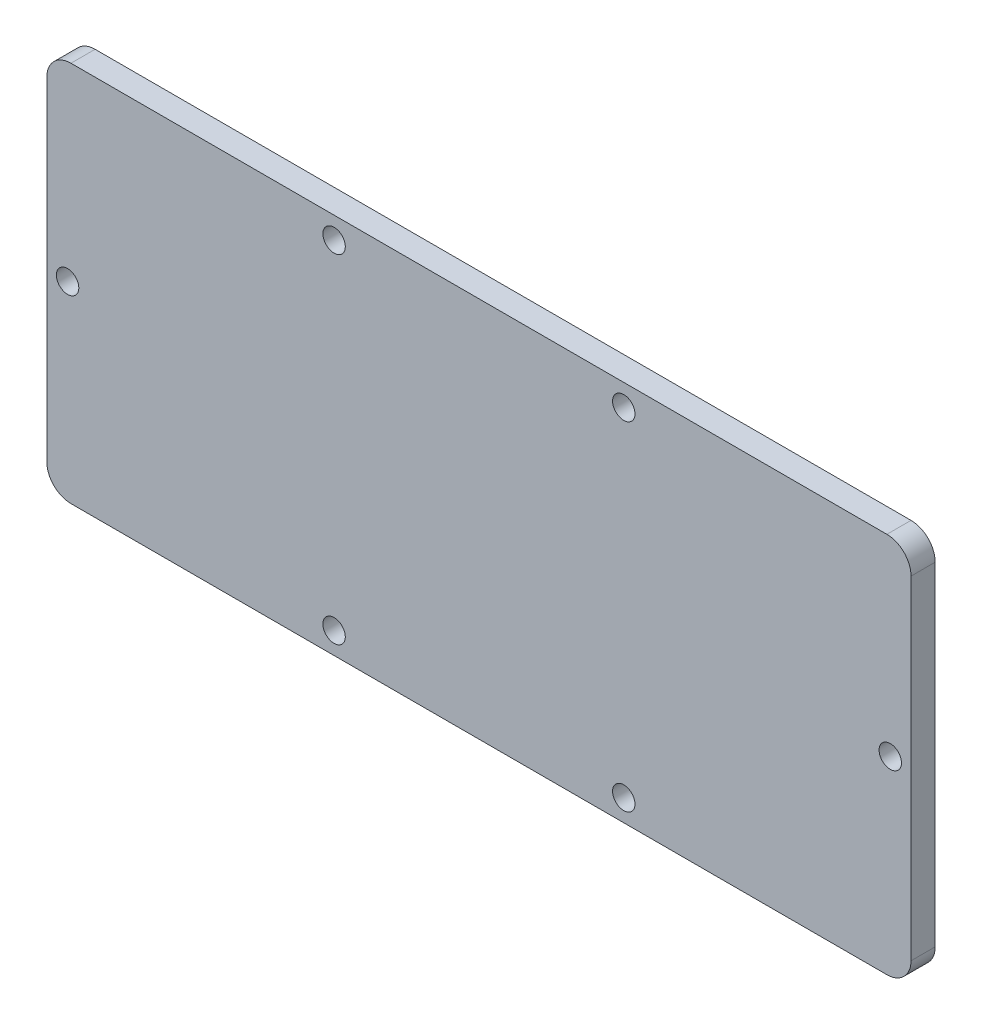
ISO-10303-21;
HEADER;
FILE_DESCRIPTION(('STEP AP214'),'2;1');
FILE_NAME('part.step','',(''),(''),'','','');
FILE_SCHEMA(('AUTOMOTIVE_DESIGN { 1 0 10303 214 1 1 1 1 }'));
ENDSEC;
DATA;
#1=APPLICATION_CONTEXT('core data for automotive mechanical design processes');
#2=APPLICATION_PROTOCOL_DEFINITION('international standard','automotive_design',2000,#1);
#3=PRODUCT_CONTEXT('',#1,'mechanical');
#4=PRODUCT('Part','Part','',(#3));
#5=PRODUCT_RELATED_PRODUCT_CATEGORY('part','',(#4));
#6=PRODUCT_DEFINITION_FORMATION('','',#4);
#7=PRODUCT_DEFINITION_CONTEXT('part definition',#1,'design');
#8=PRODUCT_DEFINITION('design','',#6,#7);
#9=PRODUCT_DEFINITION_SHAPE('','',#8);
#10=(LENGTH_UNIT() NAMED_UNIT(*) SI_UNIT(.MILLI.,.METRE.));
#11=(NAMED_UNIT(*) PLANE_ANGLE_UNIT() SI_UNIT($,.RADIAN.));
#12=(NAMED_UNIT(*) SI_UNIT($,.STERADIAN.) SOLID_ANGLE_UNIT());
#13=UNCERTAINTY_MEASURE_WITH_UNIT(LENGTH_MEASURE(1.E-05),#10,'distance_accuracy_value','');
#14=(GEOMETRIC_REPRESENTATION_CONTEXT(3) GLOBAL_UNCERTAINTY_ASSIGNED_CONTEXT((#13)) GLOBAL_UNIT_ASSIGNED_CONTEXT((#10,
#11,#12)) REPRESENTATION_CONTEXT('',''));
#15=CARTESIAN_POINT('',(0.,0.,0.));
#16=DIRECTION('',(0.,0.,1.));
#17=DIRECTION('',(1.,0.,0.));
#18=AXIS2_PLACEMENT_3D('',#15,#16,#17);
#19=CARTESIAN_POINT('',(53.6575,-21.9075,3.175));
#20=DIRECTION('',(0.,0.,-1.));
#21=DIRECTION('',(-1.,0.,0.));
#22=AXIS2_PLACEMENT_3D('',#19,#20,#21);
#23=CYLINDRICAL_SURFACE('',#22,3.175);
#24=CARTESIAN_POINT('',(53.6575,-21.9075,0.));
#25=DIRECTION('',(0.,0.,1.));
#26=DIRECTION('',(1.,0.,0.));
#27=AXIS2_PLACEMENT_3D('',#24,#25,#26);
#28=CIRCLE('',#27,3.175);
#29=CARTESIAN_POINT('',(53.6575,-25.0825,0.));
#30=VERTEX_POINT('',#29);
#31=CARTESIAN_POINT('',(56.8325,-21.9075,0.));
#32=VERTEX_POINT('',#31);
#33=EDGE_CURVE('E130',#30,#32,#28,.T.);
#34=ORIENTED_EDGE('',*,*,#33,.T.);
#35=DIRECTION('',(0.,0.,-1.));
#36=VECTOR('',#35,1.);
#37=CARTESIAN_POINT('',(56.8325,-21.9075,3.175));
#38=LINE('',#37,#36);
#39=CARTESIAN_POINT('',(56.8325,-21.9075,3.175));
#40=VERTEX_POINT('',#39);
#41=EDGE_CURVE('E11',#40,#32,#38,.T.);
#42=ORIENTED_EDGE('',*,*,#41,.F.);
#43=CARTESIAN_POINT('',(53.6575,-21.9075,3.175));
#44=DIRECTION('',(0.,0.,1.));
#45=DIRECTION('',(1.,0.,0.));
#46=AXIS2_PLACEMENT_3D('',#43,#44,#45);
#47=CIRCLE('',#46,3.175);
#48=CARTESIAN_POINT('',(53.6575,-25.0825,3.175));
#49=VERTEX_POINT('',#48);
#50=EDGE_CURVE('E145',#49,#40,#47,.T.);
#51=ORIENTED_EDGE('',*,*,#50,.F.);
#52=DIRECTION('',(0.,0.,-1.));
#53=VECTOR('',#52,1.);
#54=CARTESIAN_POINT('',(53.6575,-25.0825,3.175));
#55=LINE('',#54,#53);
#56=EDGE_CURVE('E126',#49,#30,#55,.T.);
#57=ORIENTED_EDGE('',*,*,#56,.T.);
#58=EDGE_LOOP('',(#34,#42,#51,#57));
#59=FACE_BOUND('',#58,.T.);
#60=ADVANCED_FACE('F34',(#59),#23,.T.);
#61=CARTESIAN_POINT('',(56.8325,21.9075,3.175));
#62=DIRECTION('',(-1.,0.,0.));
#63=DIRECTION('',(0.,-1.,0.));
#64=AXIS2_PLACEMENT_3D('',#61,#62,#63);
#65=PLANE('',#64);
#66=DIRECTION('',(0.,1.,0.));
#67=VECTOR('',#66,1.);
#68=CARTESIAN_POINT('',(56.8325,21.9075,0.));
#69=LINE('',#68,#67);
#70=CARTESIAN_POINT('',(56.8325,21.9075,0.));
#71=VERTEX_POINT('',#70);
#72=EDGE_CURVE('E133',#32,#71,#69,.T.);
#73=ORIENTED_EDGE('',*,*,#72,.T.);
#74=DIRECTION('',(0.,0.,-1.));
#75=VECTOR('',#74,1.);
#76=CARTESIAN_POINT('',(56.8325,21.9075,3.175));
#77=LINE('',#76,#75);
#78=CARTESIAN_POINT('',(56.8325,21.9075,3.175));
#79=VERTEX_POINT('',#78);
#80=EDGE_CURVE('E42',#79,#71,#77,.T.);
#81=ORIENTED_EDGE('',*,*,#80,.F.);
#82=DIRECTION('',(0.,1.,0.));
#83=VECTOR('',#82,1.);
#84=CARTESIAN_POINT('',(56.8325,21.9075,3.175));
#85=LINE('',#84,#83);
#86=EDGE_CURVE('E93',#40,#79,#85,.T.);
#87=ORIENTED_EDGE('',*,*,#86,.F.);
#88=ORIENTED_EDGE('',*,*,#41,.T.);
#89=EDGE_LOOP('',(#73,#81,#87,#88));
#90=FACE_BOUND('',#89,.T.);
#91=ADVANCED_FACE('F239',(#90),#65,.F.);
#92=CARTESIAN_POINT('',(53.6575,21.9075,3.175));
#93=DIRECTION('',(0.,0.,-1.));
#94=DIRECTION('',(-1.,0.,0.));
#95=AXIS2_PLACEMENT_3D('',#92,#93,#94);
#96=CYLINDRICAL_SURFACE('',#95,3.175);
#97=CARTESIAN_POINT('',(53.6575,21.9075,0.));
#98=DIRECTION('',(0.,0.,1.));
#99=DIRECTION('',(1.,0.,0.));
#100=AXIS2_PLACEMENT_3D('',#97,#98,#99);
#101=CIRCLE('',#100,3.175);
#102=CARTESIAN_POINT('',(53.6575,25.0825,0.));
#103=VERTEX_POINT('',#102);
#104=EDGE_CURVE('E136',#71,#103,#101,.T.);
#105=ORIENTED_EDGE('',*,*,#104,.T.);
#106=DIRECTION('',(0.,0.,-1.));
#107=VECTOR('',#106,1.);
#108=CARTESIAN_POINT('',(53.6575,25.0825,3.175));
#109=LINE('',#108,#107);
#110=CARTESIAN_POINT('',(53.6575,25.0825,3.175));
#111=VERTEX_POINT('',#110);
#112=EDGE_CURVE('E152',#111,#103,#109,.T.);
#113=ORIENTED_EDGE('',*,*,#112,.F.);
#114=CARTESIAN_POINT('',(53.6575,21.9075,3.175));
#115=DIRECTION('',(0.,0.,1.));
#116=DIRECTION('',(1.,0.,0.));
#117=AXIS2_PLACEMENT_3D('',#114,#115,#116);
#118=CIRCLE('',#117,3.175);
#119=EDGE_CURVE('E160',#79,#111,#118,.T.);
#120=ORIENTED_EDGE('',*,*,#119,.F.);
#121=ORIENTED_EDGE('',*,*,#80,.T.);
#122=EDGE_LOOP('',(#105,#113,#120,#121));
#123=FACE_BOUND('',#122,.T.);
#124=ADVANCED_FACE('F158',(#123),#96,.T.);
#125=CARTESIAN_POINT('',(-53.6575,25.0825,3.175));
#126=DIRECTION('',(0.,-1.,0.));
#127=DIRECTION('',(0.,0.,-1.));
#128=AXIS2_PLACEMENT_3D('',#125,#126,#127);
#129=PLANE('',#128);
#130=DIRECTION('',(-1.,0.,0.));
#131=VECTOR('',#130,1.);
#132=CARTESIAN_POINT('',(-53.6575,25.0825,0.));
#133=LINE('',#132,#131);
#134=CARTESIAN_POINT('',(-53.6575,25.0825,0.));
#135=VERTEX_POINT('',#134);
#136=EDGE_CURVE('E138',#103,#135,#133,.T.);
#137=ORIENTED_EDGE('',*,*,#136,.T.);
#138=DIRECTION('',(0.,0.,-1.));
#139=VECTOR('',#138,1.);
#140=CARTESIAN_POINT('',(-53.6575,25.0825,3.175));
#141=LINE('',#140,#139);
#142=CARTESIAN_POINT('',(-53.6575,25.0825,3.175));
#143=VERTEX_POINT('',#142);
#144=EDGE_CURVE('E149',#143,#135,#141,.T.);
#145=ORIENTED_EDGE('',*,*,#144,.F.);
#146=DIRECTION('',(-1.,0.,0.));
#147=VECTOR('',#146,1.);
#148=CARTESIAN_POINT('',(-53.6575,25.0825,3.175));
#149=LINE('',#148,#147);
#150=EDGE_CURVE('E172',#111,#143,#149,.T.);
#151=ORIENTED_EDGE('',*,*,#150,.F.);
#152=ORIENTED_EDGE('',*,*,#112,.T.);
#153=EDGE_LOOP('',(#137,#145,#151,#152));
#154=FACE_BOUND('',#153,.T.);
#155=ADVANCED_FACE('F168',(#154),#129,.F.);
#156=CARTESIAN_POINT('',(-53.6575,21.9075,3.175));
#157=DIRECTION('',(0.,0.,-1.));
#158=DIRECTION('',(-1.,0.,0.));
#159=AXIS2_PLACEMENT_3D('',#156,#157,#158);
#160=CYLINDRICAL_SURFACE('',#159,3.175);
#161=CARTESIAN_POINT('',(-53.6575,21.9075,0.));
#162=DIRECTION('',(0.,0.,1.));
#163=DIRECTION('',(1.,0.,0.));
#164=AXIS2_PLACEMENT_3D('',#161,#162,#163);
#165=CIRCLE('',#164,3.175);
#166=CARTESIAN_POINT('',(-56.8325,21.9075,0.));
#167=VERTEX_POINT('',#166);
#168=EDGE_CURVE('E140',#135,#167,#165,.T.);
#169=ORIENTED_EDGE('',*,*,#168,.T.);
#170=DIRECTION('',(0.,0.,-1.));
#171=VECTOR('',#170,1.);
#172=CARTESIAN_POINT('',(-56.8325,21.9075,3.175));
#173=LINE('',#172,#171);
#174=CARTESIAN_POINT('',(-56.8325,21.9075,3.175));
#175=VERTEX_POINT('',#174);
#176=EDGE_CURVE('E121',#175,#167,#173,.T.);
#177=ORIENTED_EDGE('',*,*,#176,.F.);
#178=CARTESIAN_POINT('',(-53.6575,21.9075,3.175));
#179=DIRECTION('',(0.,0.,1.));
#180=DIRECTION('',(1.,0.,0.));
#181=AXIS2_PLACEMENT_3D('',#178,#179,#180);
#182=CIRCLE('',#181,3.175);
#183=EDGE_CURVE('E112',#143,#175,#182,.T.);
#184=ORIENTED_EDGE('',*,*,#183,.F.);
#185=ORIENTED_EDGE('',*,*,#144,.T.);
#186=EDGE_LOOP('',(#169,#177,#184,#185));
#187=FACE_BOUND('',#186,.T.);
#188=ADVANCED_FACE('F171',(#187),#160,.T.);
#189=CARTESIAN_POINT('',(-56.8325,21.9075,3.175));
#190=DIRECTION('',(1.,0.,0.));
#191=DIRECTION('',(0.,1.,0.));
#192=AXIS2_PLACEMENT_3D('',#189,#190,#191);
#193=PLANE('',#192);
#194=DIRECTION('',(0.,-1.,0.));
#195=VECTOR('',#194,1.);
#196=CARTESIAN_POINT('',(-56.8325,21.9075,0.));
#197=LINE('',#196,#195);
#198=CARTESIAN_POINT('',(-56.8325,-21.9075,0.));
#199=VERTEX_POINT('',#198);
#200=EDGE_CURVE('E120',#167,#199,#197,.T.);
#201=ORIENTED_EDGE('',*,*,#200,.T.);
#202=DIRECTION('',(0.,0.,-1.));
#203=VECTOR('',#202,1.);
#204=CARTESIAN_POINT('',(-56.8325,-21.9075,3.175));
#205=LINE('',#204,#203);
#206=CARTESIAN_POINT('',(-56.8325,-21.9075,3.175));
#207=VERTEX_POINT('',#206);
#208=EDGE_CURVE('E117',#207,#199,#205,.T.);
#209=ORIENTED_EDGE('',*,*,#208,.F.);
#210=DIRECTION('',(0.,-1.,0.));
#211=VECTOR('',#210,1.);
#212=CARTESIAN_POINT('',(-56.8325,21.9075,3.175));
#213=LINE('',#212,#211);
#214=EDGE_CURVE('E106',#175,#207,#213,.T.);
#215=ORIENTED_EDGE('',*,*,#214,.F.);
#216=ORIENTED_EDGE('',*,*,#176,.T.);
#217=EDGE_LOOP('',(#201,#209,#215,#216));
#218=FACE_BOUND('',#217,.T.);
#219=ADVANCED_FACE('F118',(#218),#193,.F.);
#220=CARTESIAN_POINT('',(-53.6575,-21.9075,3.175));
#221=DIRECTION('',(0.,0.,-1.));
#222=DIRECTION('',(-1.,0.,0.));
#223=AXIS2_PLACEMENT_3D('',#220,#221,#222);
#224=CYLINDRICAL_SURFACE('',#223,3.175);
#225=CARTESIAN_POINT('',(-53.6575,-21.9075,0.));
#226=DIRECTION('',(0.,0.,1.));
#227=DIRECTION('',(-1.,0.,0.));
#228=AXIS2_PLACEMENT_3D('',#225,#226,#227);
#229=CIRCLE('',#228,3.175);
#230=CARTESIAN_POINT('',(-53.6575,-25.0825,0.));
#231=VERTEX_POINT('',#230);
#232=EDGE_CURVE('E79',#199,#231,#229,.T.);
#233=ORIENTED_EDGE('',*,*,#232,.T.);
#234=DIRECTION('',(0.,0.,-1.));
#235=VECTOR('',#234,1.);
#236=CARTESIAN_POINT('',(-53.6575,-25.0825,3.175));
#237=LINE('',#236,#235);
#238=CARTESIAN_POINT('',(-53.6575,-25.0825,3.175));
#239=VERTEX_POINT('',#238);
#240=EDGE_CURVE('E122',#239,#231,#237,.T.);
#241=ORIENTED_EDGE('',*,*,#240,.F.);
#242=CARTESIAN_POINT('',(-53.6575,-21.9075,3.175));
#243=DIRECTION('',(0.,0.,1.));
#244=DIRECTION('',(-1.,0.,0.));
#245=AXIS2_PLACEMENT_3D('',#242,#243,#244);
#246=CIRCLE('',#245,3.175);
#247=EDGE_CURVE('E110',#207,#239,#246,.T.);
#248=ORIENTED_EDGE('',*,*,#247,.F.);
#249=ORIENTED_EDGE('',*,*,#208,.T.);
#250=EDGE_LOOP('',(#233,#241,#248,#249));
#251=FACE_BOUND('',#250,.T.);
#252=ADVANCED_FACE('F124',(#251),#224,.T.);
#253=CARTESIAN_POINT('',(-53.6575,-25.0825,3.175));
#254=DIRECTION('',(0.,1.,0.));
#255=DIRECTION('',(0.,0.,1.));
#256=AXIS2_PLACEMENT_3D('',#253,#254,#255);
#257=PLANE('',#256);
#258=DIRECTION('',(1.,0.,0.));
#259=VECTOR('',#258,1.);
#260=CARTESIAN_POINT('',(-53.6575,-25.0825,0.));
#261=LINE('',#260,#259);
#262=EDGE_CURVE('E85',#231,#30,#261,.T.);
#263=ORIENTED_EDGE('',*,*,#262,.T.);
#264=ORIENTED_EDGE('',*,*,#56,.F.);
#265=DIRECTION('',(1.,0.,0.));
#266=VECTOR('',#265,1.);
#267=CARTESIAN_POINT('',(-53.6575,-25.0825,3.175));
#268=LINE('',#267,#266);
#269=EDGE_CURVE('E50',#239,#49,#268,.T.);
#270=ORIENTED_EDGE('',*,*,#269,.F.);
#271=ORIENTED_EDGE('',*,*,#240,.T.);
#272=EDGE_LOOP('',(#263,#264,#270,#271));
#273=FACE_BOUND('',#272,.T.);
#274=ADVANCED_FACE('F246',(#273),#257,.F.);
#275=CARTESIAN_POINT('',(53.6575,-21.9075,3.175));
#276=DIRECTION('',(0.,0.,1.));
#277=DIRECTION('',(1.,0.,0.));
#278=AXIS2_PLACEMENT_3D('',#275,#276,#277);
#279=PLANE('',#278);
#280=CARTESIAN_POINT('',(54.102,-1.04083408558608E-13,3.175));
#281=DIRECTION('',(0.,0.,-1.));
#282=DIRECTION('',(-1.,0.,0.));
#283=AXIS2_PLACEMENT_3D('',#280,#281,#282);
#284=CIRCLE('',#283,1.4732);
#285=CARTESIAN_POINT('',(52.6288,-1.04083408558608E-13,3.175));
#286=VERTEX_POINT('',#285);
#287=EDGE_CURVE('E187',#286,#286,#284,.T.);
#288=ORIENTED_EDGE('',*,*,#287,.T.);
#289=EDGE_LOOP('',(#288));
#290=FACE_BOUND('',#289,.T.);
#291=CARTESIAN_POINT('',(19.05,-22.2250000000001,3.175));
#292=DIRECTION('',(0.,0.,-1.));
#293=DIRECTION('',(-1.,0.,0.));
#294=AXIS2_PLACEMENT_3D('',#291,#292,#293);
#295=CIRCLE('',#294,1.4732);
#296=CARTESIAN_POINT('',(17.5768,-22.2250000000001,3.175));
#297=VERTEX_POINT('',#296);
#298=EDGE_CURVE('E193',#297,#297,#295,.T.);
#299=ORIENTED_EDGE('',*,*,#298,.T.);
#300=EDGE_LOOP('',(#299));
#301=FACE_BOUND('',#300,.T.);
#302=CARTESIAN_POINT('',(19.05,22.2249999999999,3.175));
#303=DIRECTION('',(0.,0.,-1.));
#304=DIRECTION('',(-1.,0.,0.));
#305=AXIS2_PLACEMENT_3D('',#302,#303,#304);
#306=CIRCLE('',#305,1.4732);
#307=CARTESIAN_POINT('',(17.5768,22.2249999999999,3.175));
#308=VERTEX_POINT('',#307);
#309=EDGE_CURVE('E199',#308,#308,#306,.T.);
#310=ORIENTED_EDGE('',*,*,#309,.T.);
#311=EDGE_LOOP('',(#310));
#312=FACE_BOUND('',#311,.T.);
#313=CARTESIAN_POINT('',(-19.05,-22.2250000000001,3.175));
#314=DIRECTION('',(0.,0.,-1.));
#315=DIRECTION('',(-1.,0.,0.));
#316=AXIS2_PLACEMENT_3D('',#313,#314,#315);
#317=CIRCLE('',#316,1.4732);
#318=CARTESIAN_POINT('',(-20.5232,-22.2250000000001,3.175));
#319=VERTEX_POINT('',#318);
#320=EDGE_CURVE('E205',#319,#319,#317,.T.);
#321=ORIENTED_EDGE('',*,*,#320,.T.);
#322=EDGE_LOOP('',(#321));
#323=FACE_BOUND('',#322,.T.);
#324=CARTESIAN_POINT('',(-54.102,-1.04083408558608E-13,3.175));
#325=DIRECTION('',(0.,0.,-1.));
#326=DIRECTION('',(-1.,0.,0.));
#327=AXIS2_PLACEMENT_3D('',#324,#325,#326);
#328=CIRCLE('',#327,1.4732);
#329=CARTESIAN_POINT('',(-55.5752,-1.04083408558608E-13,3.175));
#330=VERTEX_POINT('',#329);
#331=EDGE_CURVE('E181',#330,#330,#328,.T.);
#332=ORIENTED_EDGE('',*,*,#331,.T.);
#333=EDGE_LOOP('',(#332));
#334=FACE_BOUND('',#333,.T.);
#335=CARTESIAN_POINT('',(-19.05,22.2249999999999,3.175));
#336=DIRECTION('',(0.,0.,-1.));
#337=DIRECTION('',(-1.,0.,0.));
#338=AXIS2_PLACEMENT_3D('',#335,#336,#337);
#339=CIRCLE('',#338,1.4732);
#340=CARTESIAN_POINT('',(-20.5232,22.2249999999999,3.175));
#341=VERTEX_POINT('',#340);
#342=EDGE_CURVE('E134',#341,#341,#339,.T.);
#343=ORIENTED_EDGE('',*,*,#342,.T.);
#344=EDGE_LOOP('',(#343));
#345=FACE_BOUND('',#344,.T.);
#346=ORIENTED_EDGE('',*,*,#50,.T.);
#347=ORIENTED_EDGE('',*,*,#86,.T.);
#348=ORIENTED_EDGE('',*,*,#119,.T.);
#349=ORIENTED_EDGE('',*,*,#150,.T.);
#350=ORIENTED_EDGE('',*,*,#183,.T.);
#351=ORIENTED_EDGE('',*,*,#214,.T.);
#352=ORIENTED_EDGE('',*,*,#247,.T.);
#353=ORIENTED_EDGE('',*,*,#269,.T.);
#354=EDGE_LOOP('',(#346,#347,#348,#349,#350,#351,#352,#353));
#355=FACE_BOUND('',#354,.T.);
#356=ADVANCED_FACE('F108',(#290,#301,#312,#323,#334,#345,#355),#279,.T.);
#357=CARTESIAN_POINT('',(53.6575,-21.9075,0.));
#358=DIRECTION('',(0.,0.,1.));
#359=DIRECTION('',(1.,0.,0.));
#360=AXIS2_PLACEMENT_3D('',#357,#358,#359);
#361=PLANE('',#360);
#362=CARTESIAN_POINT('',(54.102,-1.04083408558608E-13,0.));
#363=DIRECTION('',(0.,0.,-1.));
#364=DIRECTION('',(-1.,0.,0.));
#365=AXIS2_PLACEMENT_3D('',#362,#363,#364);
#366=CIRCLE('',#365,1.4732);
#367=CARTESIAN_POINT('',(52.6288,-1.04083408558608E-13,0.));
#368=VERTEX_POINT('',#367);
#369=EDGE_CURVE('E184',#368,#368,#366,.T.);
#370=ORIENTED_EDGE('',*,*,#369,.F.);
#371=EDGE_LOOP('',(#370));
#372=FACE_BOUND('',#371,.T.);
#373=CARTESIAN_POINT('',(19.05,-22.2250000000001,0.));
#374=DIRECTION('',(0.,0.,-1.));
#375=DIRECTION('',(-1.,0.,0.));
#376=AXIS2_PLACEMENT_3D('',#373,#374,#375);
#377=CIRCLE('',#376,1.4732);
#378=CARTESIAN_POINT('',(17.5768,-22.2250000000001,0.));
#379=VERTEX_POINT('',#378);
#380=EDGE_CURVE('E190',#379,#379,#377,.T.);
#381=ORIENTED_EDGE('',*,*,#380,.F.);
#382=EDGE_LOOP('',(#381));
#383=FACE_BOUND('',#382,.T.);
#384=CARTESIAN_POINT('',(19.05,22.2249999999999,0.));
#385=DIRECTION('',(0.,0.,-1.));
#386=DIRECTION('',(-1.,0.,0.));
#387=AXIS2_PLACEMENT_3D('',#384,#385,#386);
#388=CIRCLE('',#387,1.4732);
#389=CARTESIAN_POINT('',(17.5768,22.2249999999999,0.));
#390=VERTEX_POINT('',#389);
#391=EDGE_CURVE('E196',#390,#390,#388,.T.);
#392=ORIENTED_EDGE('',*,*,#391,.F.);
#393=EDGE_LOOP('',(#392));
#394=FACE_BOUND('',#393,.T.);
#395=CARTESIAN_POINT('',(-19.05,-22.2250000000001,0.));
#396=DIRECTION('',(0.,0.,-1.));
#397=DIRECTION('',(-1.,0.,0.));
#398=AXIS2_PLACEMENT_3D('',#395,#396,#397);
#399=CIRCLE('',#398,1.4732);
#400=CARTESIAN_POINT('',(-20.5232,-22.2250000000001,0.));
#401=VERTEX_POINT('',#400);
#402=EDGE_CURVE('E202',#401,#401,#399,.T.);
#403=ORIENTED_EDGE('',*,*,#402,.F.);
#404=EDGE_LOOP('',(#403));
#405=FACE_BOUND('',#404,.T.);
#406=CARTESIAN_POINT('',(-54.102,-1.04083408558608E-13,0.));
#407=DIRECTION('',(0.,0.,-1.));
#408=DIRECTION('',(-1.,0.,0.));
#409=AXIS2_PLACEMENT_3D('',#406,#407,#408);
#410=CIRCLE('',#409,1.4732);
#411=CARTESIAN_POINT('',(-55.5752,-1.04083408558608E-13,0.));
#412=VERTEX_POINT('',#411);
#413=EDGE_CURVE('E208',#412,#412,#410,.T.);
#414=ORIENTED_EDGE('',*,*,#413,.F.);
#415=EDGE_LOOP('',(#414));
#416=FACE_BOUND('',#415,.T.);
#417=CARTESIAN_POINT('',(-19.05,22.2249999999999,0.));
#418=DIRECTION('',(0.,0.,-1.));
#419=DIRECTION('',(-1.,0.,0.));
#420=AXIS2_PLACEMENT_3D('',#417,#418,#419);
#421=CIRCLE('',#420,1.4732);
#422=CARTESIAN_POINT('',(-20.5232,22.2249999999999,0.));
#423=VERTEX_POINT('',#422);
#424=EDGE_CURVE('E178',#423,#423,#421,.T.);
#425=ORIENTED_EDGE('',*,*,#424,.F.);
#426=EDGE_LOOP('',(#425));
#427=FACE_BOUND('',#426,.T.);
#428=ORIENTED_EDGE('',*,*,#33,.F.);
#429=ORIENTED_EDGE('',*,*,#262,.F.);
#430=ORIENTED_EDGE('',*,*,#232,.F.);
#431=ORIENTED_EDGE('',*,*,#200,.F.);
#432=ORIENTED_EDGE('',*,*,#168,.F.);
#433=ORIENTED_EDGE('',*,*,#136,.F.);
#434=ORIENTED_EDGE('',*,*,#104,.F.);
#435=ORIENTED_EDGE('',*,*,#72,.F.);
#436=EDGE_LOOP('',(#428,#429,#430,#431,#432,#433,#434,#435));
#437=FACE_BOUND('',#436,.T.);
#438=ADVANCED_FACE('F164',(#372,#383,#394,#405,#416,#427,#437),#361,.F.);
#439=CARTESIAN_POINT('',(-19.05,22.2249999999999,3.175));
#440=DIRECTION('',(0.,0.,-1.));
#441=DIRECTION('',(-1.,0.,0.));
#442=AXIS2_PLACEMENT_3D('',#439,#440,#441);
#443=CYLINDRICAL_SURFACE('',#442,1.4732);
#444=ORIENTED_EDGE('',*,*,#342,.F.);
#445=EDGE_LOOP('',(#444));
#446=FACE_BOUND('',#445,.T.);
#447=ORIENTED_EDGE('',*,*,#424,.T.);
#448=EDGE_LOOP('',(#447));
#449=FACE_BOUND('',#448,.T.);
#450=ADVANCED_FACE('F220',(#446,#449),#443,.F.);
#451=CARTESIAN_POINT('',(-54.102,-1.04083408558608E-13,3.175));
#452=DIRECTION('',(0.,0.,-1.));
#453=DIRECTION('',(-1.,0.,0.));
#454=AXIS2_PLACEMENT_3D('',#451,#452,#453);
#455=CYLINDRICAL_SURFACE('',#454,1.4732);
#456=ORIENTED_EDGE('',*,*,#331,.F.);
#457=EDGE_LOOP('',(#456));
#458=FACE_BOUND('',#457,.T.);
#459=ORIENTED_EDGE('',*,*,#413,.T.);
#460=EDGE_LOOP('',(#459));
#461=FACE_BOUND('',#460,.T.);
#462=ADVANCED_FACE('F216',(#458,#461),#455,.F.);
#463=CARTESIAN_POINT('',(-19.05,-22.2250000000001,3.175));
#464=DIRECTION('',(0.,0.,-1.));
#465=DIRECTION('',(-1.,0.,0.));
#466=AXIS2_PLACEMENT_3D('',#463,#464,#465);
#467=CYLINDRICAL_SURFACE('',#466,1.4732);
#468=ORIENTED_EDGE('',*,*,#320,.F.);
#469=EDGE_LOOP('',(#468));
#470=FACE_BOUND('',#469,.T.);
#471=ORIENTED_EDGE('',*,*,#402,.T.);
#472=EDGE_LOOP('',(#471));
#473=FACE_BOUND('',#472,.T.);
#474=ADVANCED_FACE('F219',(#470,#473),#467,.F.);
#475=CARTESIAN_POINT('',(19.05,22.2249999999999,3.175));
#476=DIRECTION('',(0.,0.,-1.));
#477=DIRECTION('',(-1.,0.,0.));
#478=AXIS2_PLACEMENT_3D('',#475,#476,#477);
#479=CYLINDRICAL_SURFACE('',#478,1.4732);
#480=ORIENTED_EDGE('',*,*,#309,.F.);
#481=EDGE_LOOP('',(#480));
#482=FACE_BOUND('',#481,.T.);
#483=ORIENTED_EDGE('',*,*,#391,.T.);
#484=EDGE_LOOP('',(#483));
#485=FACE_BOUND('',#484,.T.);
#486=ADVANCED_FACE('F318',(#482,#485),#479,.F.);
#487=CARTESIAN_POINT('',(19.05,-22.2250000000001,3.175));
#488=DIRECTION('',(0.,0.,-1.));
#489=DIRECTION('',(-1.,0.,0.));
#490=AXIS2_PLACEMENT_3D('',#487,#488,#489);
#491=CYLINDRICAL_SURFACE('',#490,1.4732);
#492=ORIENTED_EDGE('',*,*,#298,.F.);
#493=EDGE_LOOP('',(#492));
#494=FACE_BOUND('',#493,.T.);
#495=ORIENTED_EDGE('',*,*,#380,.T.);
#496=EDGE_LOOP('',(#495));
#497=FACE_BOUND('',#496,.T.);
#498=ADVANCED_FACE('F328',(#494,#497),#491,.F.);
#499=CARTESIAN_POINT('',(54.102,-1.04083408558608E-13,3.175));
#500=DIRECTION('',(0.,0.,-1.));
#501=DIRECTION('',(-1.,0.,0.));
#502=AXIS2_PLACEMENT_3D('',#499,#500,#501);
#503=CYLINDRICAL_SURFACE('',#502,1.4732);
#504=ORIENTED_EDGE('',*,*,#287,.F.);
#505=EDGE_LOOP('',(#504));
#506=FACE_BOUND('',#505,.T.);
#507=ORIENTED_EDGE('',*,*,#369,.T.);
#508=EDGE_LOOP('',(#507));
#509=FACE_BOUND('',#508,.T.);
#510=ADVANCED_FACE('F338',(#506,#509),#503,.F.);
#511=CLOSED_SHELL('',(#60,#91,#124,#155,#188,#219,#252,#274,#356,#438,#450,#462,#474,#486,#498,#510));
#512=MANIFOLD_SOLID_BREP('B2',#511);
#513=ADVANCED_BREP_SHAPE_REPRESENTATION('',(#18,#512),#14);
#514=SHAPE_DEFINITION_REPRESENTATION(#9,#513);
ENDSEC;
END-ISO-10303-21;
